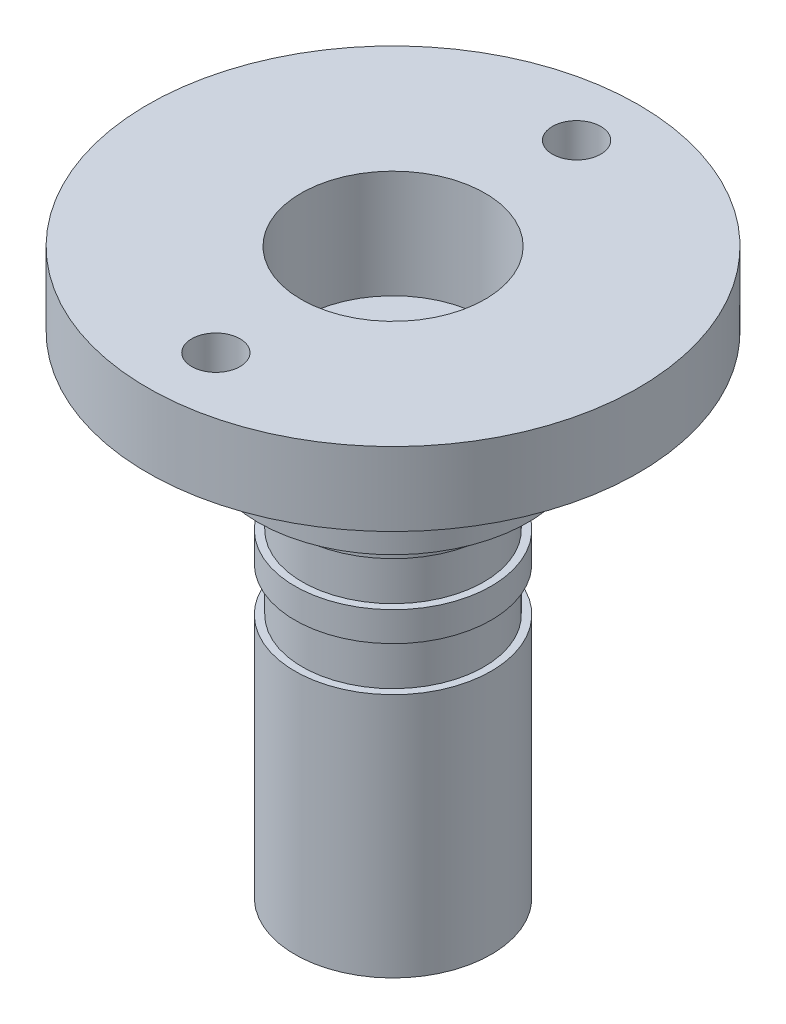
ISO-10303-21;
HEADER;
FILE_DESCRIPTION(('STEP AP214'),'2;1');
FILE_NAME('part.step','',(''),(''),'','','');
FILE_SCHEMA(('AUTOMOTIVE_DESIGN { 1 0 10303 214 1 1 1 1 }'));
ENDSEC;
DATA;
#1=APPLICATION_CONTEXT('core data for automotive mechanical design processes');
#2=APPLICATION_PROTOCOL_DEFINITION('international standard','automotive_design',2000,#1);
#3=PRODUCT_CONTEXT('',#1,'mechanical');
#4=PRODUCT('Part','Part','',(#3));
#5=PRODUCT_RELATED_PRODUCT_CATEGORY('part','',(#4));
#6=PRODUCT_DEFINITION_FORMATION('','',#4);
#7=PRODUCT_DEFINITION_CONTEXT('part definition',#1,'design');
#8=PRODUCT_DEFINITION('design','',#6,#7);
#9=PRODUCT_DEFINITION_SHAPE('','',#8);
#10=(LENGTH_UNIT() NAMED_UNIT(*) SI_UNIT(.MILLI.,.METRE.));
#11=(NAMED_UNIT(*) PLANE_ANGLE_UNIT() SI_UNIT($,.RADIAN.));
#12=(NAMED_UNIT(*) SI_UNIT($,.STERADIAN.) SOLID_ANGLE_UNIT());
#13=UNCERTAINTY_MEASURE_WITH_UNIT(LENGTH_MEASURE(1.E-05),#10,'distance_accuracy_value','');
#14=(GEOMETRIC_REPRESENTATION_CONTEXT(3) GLOBAL_UNCERTAINTY_ASSIGNED_CONTEXT((#13)) GLOBAL_UNIT_ASSIGNED_CONTEXT((#10,
#11,#12)) REPRESENTATION_CONTEXT('',''));
#15=CARTESIAN_POINT('',(0.,0.,0.));
#16=DIRECTION('',(0.,0.,1.));
#17=DIRECTION('',(1.,0.,0.));
#18=AXIS2_PLACEMENT_3D('',#15,#16,#17);
#19=CARTESIAN_POINT('',(0.,16.51,0.));
#20=DIRECTION('',(0.,-1.,0.));
#21=DIRECTION('',(0.,0.,-1.));
#22=AXIS2_PLACEMENT_3D('',#19,#20,#21);
#23=CYLINDRICAL_SURFACE('',#22,12.7);
#24=CARTESIAN_POINT('',(0.,16.51,0.));
#25=DIRECTION('',(0.,-1.,0.));
#26=DIRECTION('',(0.,0.,-1.));
#27=AXIS2_PLACEMENT_3D('',#24,#25,#26);
#28=CIRCLE('',#27,12.7);
#29=CARTESIAN_POINT('',(0.,16.51,-12.7));
#30=VERTEX_POINT('',#29);
#31=EDGE_CURVE('E10',#30,#30,#28,.T.);
#32=ORIENTED_EDGE('',*,*,#31,.T.);
#33=EDGE_LOOP('',(#32));
#34=FACE_BOUND('',#33,.T.);
#35=CARTESIAN_POINT('',(0.,12.7,0.));
#36=DIRECTION('',(0.,-1.,0.));
#37=DIRECTION('',(0.,0.,-1.));
#38=AXIS2_PLACEMENT_3D('',#35,#36,#37);
#39=CIRCLE('',#38,12.7);
#40=CARTESIAN_POINT('',(0.,12.7,-12.7));
#41=VERTEX_POINT('',#40);
#42=EDGE_CURVE('E77',#41,#41,#39,.T.);
#43=ORIENTED_EDGE('',*,*,#42,.F.);
#44=EDGE_LOOP('',(#43));
#45=FACE_BOUND('',#44,.T.);
#46=ADVANCED_FACE('F31',(#34,#45),#23,.T.);
#47=CARTESIAN_POINT('',(12.7,16.51,0.));
#48=DIRECTION('',(0.,1.,0.));
#49=DIRECTION('',(0.,0.,1.));
#50=AXIS2_PLACEMENT_3D('',#47,#48,#49);
#51=PLANE('',#50);
#52=CARTESIAN_POINT('',(0.,16.51,0.));
#53=DIRECTION('',(0.,1.,0.));
#54=DIRECTION('',(0.,0.,1.));
#55=AXIS2_PLACEMENT_3D('',#52,#53,#54);
#56=CIRCLE('',#55,4.76250000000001);
#57=CARTESIAN_POINT('',(0.,16.51,4.76250000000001));
#58=VERTEX_POINT('',#57);
#59=EDGE_CURVE('E101',#58,#58,#56,.T.);
#60=ORIENTED_EDGE('',*,*,#59,.F.);
#61=EDGE_LOOP('',(#60));
#62=FACE_BOUND('',#61,.T.);
#63=CARTESIAN_POINT('',(0.185052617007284,16.51,9.35622749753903));
#64=DIRECTION('',(0.,-1.,0.));
#65=DIRECTION('',(0.,0.,-1.));
#66=AXIS2_PLACEMENT_3D('',#63,#64,#65);
#67=CIRCLE('',#66,1.24993399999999);
#68=CARTESIAN_POINT('',(0.185052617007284,16.51,8.10629349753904));
#69=VERTEX_POINT('',#68);
#70=EDGE_CURVE('E86',#69,#69,#67,.T.);
#71=ORIENTED_EDGE('',*,*,#70,.T.);
#72=EDGE_LOOP('',(#71));
#73=FACE_BOUND('',#72,.T.);
#74=CARTESIAN_POINT('',(0.,16.51,-9.4996));
#75=DIRECTION('',(0.,-1.,0.));
#76=DIRECTION('',(0.,0.,-1.));
#77=AXIS2_PLACEMENT_3D('',#74,#75,#76);
#78=CIRCLE('',#77,1.24993399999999);
#79=CARTESIAN_POINT('',(0.,16.51,-10.749534));
#80=VERTEX_POINT('',#79);
#81=EDGE_CURVE('E80',#80,#80,#78,.T.);
#82=ORIENTED_EDGE('',*,*,#81,.T.);
#83=EDGE_LOOP('',(#82));
#84=FACE_BOUND('',#83,.T.);
#85=ORIENTED_EDGE('',*,*,#31,.F.);
#86=EDGE_LOOP('',(#85));
#87=FACE_BOUND('',#86,.T.);
#88=ADVANCED_FACE('F107',(#62,#73,#84,#87),#51,.T.);
#89=CARTESIAN_POINT('',(0.,-12.7,0.));
#90=DIRECTION('',(0.,-1.,0.));
#91=DIRECTION('',(0.,0.,-1.));
#92=AXIS2_PLACEMENT_3D('',#89,#90,#91);
#93=PLANE('',#92);
#94=CARTESIAN_POINT('',(0.,-12.7,0.));
#95=DIRECTION('',(0.,1.,0.));
#96=DIRECTION('',(0.,0.,1.));
#97=AXIS2_PLACEMENT_3D('',#94,#95,#96);
#98=CIRCLE('',#97,2.54000000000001);
#99=CARTESIAN_POINT('',(0.,-12.7,2.54000000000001));
#100=VERTEX_POINT('',#99);
#101=EDGE_CURVE('E92',#100,#100,#98,.T.);
#102=ORIENTED_EDGE('',*,*,#101,.T.);
#103=EDGE_LOOP('',(#102));
#104=FACE_BOUND('',#103,.T.);
#105=CARTESIAN_POINT('',(0.,-12.7,0.));
#106=DIRECTION('',(0.,-1.,0.));
#107=DIRECTION('',(0.,0.,-1.));
#108=AXIS2_PLACEMENT_3D('',#105,#106,#107);
#109=CIRCLE('',#108,5.08);
#110=CARTESIAN_POINT('',(0.,-12.7,-5.08));
#111=VERTEX_POINT('',#110);
#112=EDGE_CURVE('E37',#111,#111,#109,.T.);
#113=ORIENTED_EDGE('',*,*,#112,.T.);
#114=EDGE_LOOP('',(#113));
#115=FACE_BOUND('',#114,.T.);
#116=ADVANCED_FACE('F110',(#104,#115),#93,.T.);
#117=CARTESIAN_POINT('',(0.,16.51,0.));
#118=DIRECTION('',(0.,-1.,0.));
#119=DIRECTION('',(0.,0.,-1.));
#120=AXIS2_PLACEMENT_3D('',#117,#118,#119);
#121=CYLINDRICAL_SURFACE('',#120,5.08);
#122=CARTESIAN_POINT('',(0.,0.,0.));
#123=DIRECTION('',(0.,-1.,0.));
#124=DIRECTION('',(0.,0.,-1.));
#125=AXIS2_PLACEMENT_3D('',#122,#123,#124);
#126=CIRCLE('',#125,5.08);
#127=CARTESIAN_POINT('',(0.,0.,-5.08));
#128=VERTEX_POINT('',#127);
#129=EDGE_CURVE('E41',#128,#128,#126,.T.);
#130=ORIENTED_EDGE('',*,*,#129,.T.);
#131=EDGE_LOOP('',(#130));
#132=FACE_BOUND('',#131,.T.);
#133=ORIENTED_EDGE('',*,*,#112,.F.);
#134=EDGE_LOOP('',(#133));
#135=FACE_BOUND('',#134,.T.);
#136=ADVANCED_FACE('F189',(#132,#135),#121,.T.);
#137=CARTESIAN_POINT('',(5.08,0.,0.));
#138=DIRECTION('',(0.,1.,0.));
#139=DIRECTION('',(0.,0.,1.));
#140=AXIS2_PLACEMENT_3D('',#137,#138,#139);
#141=PLANE('',#140);
#142=CARTESIAN_POINT('',(0.,0.,0.));
#143=DIRECTION('',(0.,-1.,0.));
#144=DIRECTION('',(0.,0.,-1.));
#145=AXIS2_PLACEMENT_3D('',#142,#143,#144);
#146=CIRCLE('',#145,4.699);
#147=CARTESIAN_POINT('',(0.,0.,-4.699));
#148=VERTEX_POINT('',#147);
#149=EDGE_CURVE('E45',#148,#148,#146,.T.);
#150=ORIENTED_EDGE('',*,*,#149,.T.);
#151=EDGE_LOOP('',(#150));
#152=FACE_BOUND('',#151,.T.);
#153=ORIENTED_EDGE('',*,*,#129,.F.);
#154=EDGE_LOOP('',(#153));
#155=FACE_BOUND('',#154,.T.);
#156=ADVANCED_FACE('F183',(#152,#155),#141,.T.);
#157=CARTESIAN_POINT('',(0.,16.51,0.));
#158=DIRECTION('',(0.,-1.,0.));
#159=DIRECTION('',(0.,0.,-1.));
#160=AXIS2_PLACEMENT_3D('',#157,#158,#159);
#161=CYLINDRICAL_SURFACE('',#160,4.699);
#162=CARTESIAN_POINT('',(0.,2.286,0.));
#163=DIRECTION('',(0.,-1.,0.));
#164=DIRECTION('',(0.,0.,-1.));
#165=AXIS2_PLACEMENT_3D('',#162,#163,#164);
#166=CIRCLE('',#165,4.699);
#167=CARTESIAN_POINT('',(0.,2.286,-4.699));
#168=VERTEX_POINT('',#167);
#169=EDGE_CURVE('E50',#168,#168,#166,.T.);
#170=ORIENTED_EDGE('',*,*,#169,.T.);
#171=EDGE_LOOP('',(#170));
#172=FACE_BOUND('',#171,.T.);
#173=ORIENTED_EDGE('',*,*,#149,.F.);
#174=EDGE_LOOP('',(#173));
#175=FACE_BOUND('',#174,.T.);
#176=ADVANCED_FACE('F177',(#172,#175),#161,.T.);
#177=CARTESIAN_POINT('',(4.699,2.286,0.));
#178=DIRECTION('',(0.,-1.,0.));
#179=DIRECTION('',(0.,0.,-1.));
#180=AXIS2_PLACEMENT_3D('',#177,#178,#179);
#181=PLANE('',#180);
#182=CARTESIAN_POINT('',(0.,2.286,0.));
#183=DIRECTION('',(0.,-1.,0.));
#184=DIRECTION('',(0.,0.,-1.));
#185=AXIS2_PLACEMENT_3D('',#182,#183,#184);
#186=CIRCLE('',#185,5.08);
#187=CARTESIAN_POINT('',(0.,2.286,-5.08));
#188=VERTEX_POINT('',#187);
#189=EDGE_CURVE('E53',#188,#188,#186,.T.);
#190=ORIENTED_EDGE('',*,*,#189,.T.);
#191=EDGE_LOOP('',(#190));
#192=FACE_BOUND('',#191,.T.);
#193=ORIENTED_EDGE('',*,*,#169,.F.);
#194=EDGE_LOOP('',(#193));
#195=FACE_BOUND('',#194,.T.);
#196=ADVANCED_FACE('F171',(#192,#195),#181,.T.);
#197=CARTESIAN_POINT('',(0.,16.51,0.));
#198=DIRECTION('',(0.,-1.,0.));
#199=DIRECTION('',(0.,0.,-1.));
#200=AXIS2_PLACEMENT_3D('',#197,#198,#199);
#201=CYLINDRICAL_SURFACE('',#200,5.08);
#202=CARTESIAN_POINT('',(0.,3.81,0.));
#203=DIRECTION('',(0.,-1.,0.));
#204=DIRECTION('',(0.,0.,-1.));
#205=AXIS2_PLACEMENT_3D('',#202,#203,#204);
#206=CIRCLE('',#205,5.08);
#207=CARTESIAN_POINT('',(0.,3.81,-5.08));
#208=VERTEX_POINT('',#207);
#209=EDGE_CURVE('E56',#208,#208,#206,.T.);
#210=ORIENTED_EDGE('',*,*,#209,.T.);
#211=EDGE_LOOP('',(#210));
#212=FACE_BOUND('',#211,.T.);
#213=ORIENTED_EDGE('',*,*,#189,.F.);
#214=EDGE_LOOP('',(#213));
#215=FACE_BOUND('',#214,.T.);
#216=ADVANCED_FACE('F165',(#212,#215),#201,.T.);
#217=CARTESIAN_POINT('',(5.08,3.81,0.));
#218=DIRECTION('',(0.,1.,0.));
#219=DIRECTION('',(0.,0.,1.));
#220=AXIS2_PLACEMENT_3D('',#217,#218,#219);
#221=PLANE('',#220);
#222=CARTESIAN_POINT('',(0.,3.81,0.));
#223=DIRECTION('',(0.,-1.,0.));
#224=DIRECTION('',(0.,0.,-1.));
#225=AXIS2_PLACEMENT_3D('',#222,#223,#224);
#226=CIRCLE('',#225,4.699);
#227=CARTESIAN_POINT('',(0.,3.81,-4.699));
#228=VERTEX_POINT('',#227);
#229=EDGE_CURVE('E59',#228,#228,#226,.T.);
#230=ORIENTED_EDGE('',*,*,#229,.T.);
#231=EDGE_LOOP('',(#230));
#232=FACE_BOUND('',#231,.T.);
#233=ORIENTED_EDGE('',*,*,#209,.F.);
#234=EDGE_LOOP('',(#233));
#235=FACE_BOUND('',#234,.T.);
#236=ADVANCED_FACE('F159',(#232,#235),#221,.T.);
#237=CARTESIAN_POINT('',(0.,16.51,0.));
#238=DIRECTION('',(0.,-1.,0.));
#239=DIRECTION('',(0.,0.,-1.));
#240=AXIS2_PLACEMENT_3D('',#237,#238,#239);
#241=CYLINDRICAL_SURFACE('',#240,4.699);
#242=CARTESIAN_POINT('',(0.,6.09599999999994,0.));
#243=DIRECTION('',(0.,-1.,0.));
#244=DIRECTION('',(0.,0.,-1.));
#245=AXIS2_PLACEMENT_3D('',#242,#243,#244);
#246=CIRCLE('',#245,4.699);
#247=CARTESIAN_POINT('',(0.,6.09599999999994,-4.699));
#248=VERTEX_POINT('',#247);
#249=EDGE_CURVE('E62',#248,#248,#246,.T.);
#250=ORIENTED_EDGE('',*,*,#249,.T.);
#251=EDGE_LOOP('',(#250));
#252=FACE_BOUND('',#251,.T.);
#253=ORIENTED_EDGE('',*,*,#229,.F.);
#254=EDGE_LOOP('',(#253));
#255=FACE_BOUND('',#254,.T.);
#256=ADVANCED_FACE('F153',(#252,#255),#241,.T.);
#257=CARTESIAN_POINT('',(4.699,6.09599999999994,0.));
#258=DIRECTION('',(0.,-1.,0.));
#259=DIRECTION('',(0.,0.,-1.));
#260=AXIS2_PLACEMENT_3D('',#257,#258,#259);
#261=PLANE('',#260);
#262=CARTESIAN_POINT('',(0.,6.09599999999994,0.));
#263=DIRECTION('',(0.,-1.,0.));
#264=DIRECTION('',(0.,0.,-1.));
#265=AXIS2_PLACEMENT_3D('',#262,#263,#264);
#266=CIRCLE('',#265,5.08);
#267=CARTESIAN_POINT('',(0.,6.09599999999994,-5.08));
#268=VERTEX_POINT('',#267);
#269=EDGE_CURVE('E65',#268,#268,#266,.T.);
#270=ORIENTED_EDGE('',*,*,#269,.T.);
#271=EDGE_LOOP('',(#270));
#272=FACE_BOUND('',#271,.T.);
#273=ORIENTED_EDGE('',*,*,#249,.F.);
#274=EDGE_LOOP('',(#273));
#275=FACE_BOUND('',#274,.T.);
#276=ADVANCED_FACE('F147',(#272,#275),#261,.T.);
#277=CARTESIAN_POINT('',(0.,16.51,0.));
#278=DIRECTION('',(0.,-1.,0.));
#279=DIRECTION('',(0.,0.,-1.));
#280=AXIS2_PLACEMENT_3D('',#277,#278,#279);
#281=CYLINDRICAL_SURFACE('',#280,5.08);
#282=CARTESIAN_POINT('',(0.,7.62000000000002,0.));
#283=DIRECTION('',(0.,-1.,0.));
#284=DIRECTION('',(0.,0.,-1.));
#285=AXIS2_PLACEMENT_3D('',#282,#283,#284);
#286=CIRCLE('',#285,5.08);
#287=CARTESIAN_POINT('',(0.,7.62000000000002,-5.08));
#288=VERTEX_POINT('',#287);
#289=EDGE_CURVE('E68',#288,#288,#286,.T.);
#290=ORIENTED_EDGE('',*,*,#289,.T.);
#291=EDGE_LOOP('',(#290));
#292=FACE_BOUND('',#291,.T.);
#293=ORIENTED_EDGE('',*,*,#269,.F.);
#294=EDGE_LOOP('',(#293));
#295=FACE_BOUND('',#294,.T.);
#296=ADVANCED_FACE('F141',(#292,#295),#281,.T.);
#297=CARTESIAN_POINT('',(5.08,7.62000000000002,0.));
#298=DIRECTION('',(0.,-1.,0.));
#299=DIRECTION('',(0.,0.,-1.));
#300=AXIS2_PLACEMENT_3D('',#297,#298,#299);
#301=PLANE('',#300);
#302=CARTESIAN_POINT('',(0.,7.62000000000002,0.));
#303=DIRECTION('',(0.,-1.,0.));
#304=DIRECTION('',(0.,0.,-1.));
#305=AXIS2_PLACEMENT_3D('',#302,#303,#304);
#306=CIRCLE('',#305,6.985);
#307=CARTESIAN_POINT('',(0.,7.62000000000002,-6.985));
#308=VERTEX_POINT('',#307);
#309=EDGE_CURVE('E71',#308,#308,#306,.T.);
#310=ORIENTED_EDGE('',*,*,#309,.T.);
#311=EDGE_LOOP('',(#310));
#312=FACE_BOUND('',#311,.T.);
#313=ORIENTED_EDGE('',*,*,#289,.F.);
#314=EDGE_LOOP('',(#313));
#315=FACE_BOUND('',#314,.T.);
#316=ADVANCED_FACE('F135',(#312,#315),#301,.T.);
#317=CARTESIAN_POINT('',(0.,16.51,0.));
#318=DIRECTION('',(0.,-1.,0.));
#319=DIRECTION('',(0.,0.,-1.));
#320=AXIS2_PLACEMENT_3D('',#317,#318,#319);
#321=CYLINDRICAL_SURFACE('',#320,6.985);
#322=CARTESIAN_POINT('',(0.,12.7,0.));
#323=DIRECTION('',(0.,-1.,0.));
#324=DIRECTION('',(0.,0.,-1.));
#325=AXIS2_PLACEMENT_3D('',#322,#323,#324);
#326=CIRCLE('',#325,6.985);
#327=CARTESIAN_POINT('',(0.,12.7,-6.985));
#328=VERTEX_POINT('',#327);
#329=EDGE_CURVE('E74',#328,#328,#326,.T.);
#330=ORIENTED_EDGE('',*,*,#329,.T.);
#331=EDGE_LOOP('',(#330));
#332=FACE_BOUND('',#331,.T.);
#333=ORIENTED_EDGE('',*,*,#309,.F.);
#334=EDGE_LOOP('',(#333));
#335=FACE_BOUND('',#334,.T.);
#336=ADVANCED_FACE('F126',(#332,#335),#321,.T.);
#337=CARTESIAN_POINT('',(6.985,12.7,0.));
#338=DIRECTION('',(0.,-1.,0.));
#339=DIRECTION('',(0.,0.,-1.));
#340=AXIS2_PLACEMENT_3D('',#337,#338,#339);
#341=PLANE('',#340);
#342=CARTESIAN_POINT('',(0.185052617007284,12.7,9.35622749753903));
#343=DIRECTION('',(0.,-1.,0.));
#344=DIRECTION('',(0.,0.,-1.));
#345=AXIS2_PLACEMENT_3D('',#342,#343,#344);
#346=CIRCLE('',#345,1.24993399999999);
#347=CARTESIAN_POINT('',(0.185052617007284,12.7,8.10629349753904));
#348=VERTEX_POINT('',#347);
#349=EDGE_CURVE('E89',#348,#348,#346,.T.);
#350=ORIENTED_EDGE('',*,*,#349,.F.);
#351=EDGE_LOOP('',(#350));
#352=FACE_BOUND('',#351,.T.);
#353=CARTESIAN_POINT('',(0.,12.7,-9.4996));
#354=DIRECTION('',(0.,-1.,0.));
#355=DIRECTION('',(0.,0.,-1.));
#356=AXIS2_PLACEMENT_3D('',#353,#354,#355);
#357=CIRCLE('',#356,1.24993399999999);
#358=CARTESIAN_POINT('',(0.,12.7,-10.749534));
#359=VERTEX_POINT('',#358);
#360=EDGE_CURVE('E83',#359,#359,#357,.T.);
#361=ORIENTED_EDGE('',*,*,#360,.F.);
#362=EDGE_LOOP('',(#361));
#363=FACE_BOUND('',#362,.T.);
#364=ORIENTED_EDGE('',*,*,#42,.T.);
#365=EDGE_LOOP('',(#364));
#366=FACE_BOUND('',#365,.T.);
#367=ORIENTED_EDGE('',*,*,#329,.F.);
#368=EDGE_LOOP('',(#367));
#369=FACE_BOUND('',#368,.T.);
#370=ADVANCED_FACE('F120',(#352,#363,#366,#369),#341,.T.);
#371=CARTESIAN_POINT('',(0.,12.7,-9.4996));
#372=DIRECTION('',(0.,-1.,0.));
#373=DIRECTION('',(0.,0.,-1.));
#374=AXIS2_PLACEMENT_3D('',#371,#372,#373);
#375=CYLINDRICAL_SURFACE('',#374,1.24993399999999);
#376=ORIENTED_EDGE('',*,*,#81,.F.);
#377=EDGE_LOOP('',(#376));
#378=FACE_BOUND('',#377,.T.);
#379=ORIENTED_EDGE('',*,*,#360,.T.);
#380=EDGE_LOOP('',(#379));
#381=FACE_BOUND('',#380,.T.);
#382=ADVANCED_FACE('F116',(#378,#381),#375,.F.);
#383=CARTESIAN_POINT('',(0.185052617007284,12.7,9.35622749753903));
#384=DIRECTION('',(0.,-1.,0.));
#385=DIRECTION('',(0.,0.,-1.));
#386=AXIS2_PLACEMENT_3D('',#383,#384,#385);
#387=CYLINDRICAL_SURFACE('',#386,1.24993399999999);
#388=ORIENTED_EDGE('',*,*,#70,.F.);
#389=EDGE_LOOP('',(#388));
#390=FACE_BOUND('',#389,.T.);
#391=ORIENTED_EDGE('',*,*,#349,.T.);
#392=EDGE_LOOP('',(#391));
#393=FACE_BOUND('',#392,.T.);
#394=ADVANCED_FACE('F119',(#390,#393),#387,.F.);
#395=CARTESIAN_POINT('',(0.,16.51,0.));
#396=DIRECTION('',(0.,1.,0.));
#397=DIRECTION('',(0.,0.,1.));
#398=AXIS2_PLACEMENT_3D('',#395,#396,#397);
#399=CYLINDRICAL_SURFACE('',#398,2.54000000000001);
#400=ORIENTED_EDGE('',*,*,#101,.F.);
#401=EDGE_LOOP('',(#400));
#402=FACE_BOUND('',#401,.T.);
#403=CARTESIAN_POINT('',(0.,10.922,0.));
#404=DIRECTION('',(0.,1.,0.));
#405=DIRECTION('',(0.,0.,1.));
#406=AXIS2_PLACEMENT_3D('',#403,#404,#405);
#407=CIRCLE('',#406,2.54000000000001);
#408=CARTESIAN_POINT('',(0.,10.922,2.54000000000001));
#409=VERTEX_POINT('',#408);
#410=EDGE_CURVE('E95',#409,#409,#407,.T.);
#411=ORIENTED_EDGE('',*,*,#410,.T.);
#412=EDGE_LOOP('',(#411));
#413=FACE_BOUND('',#412,.T.);
#414=ADVANCED_FACE('F220',(#402,#413),#399,.F.);
#415=CARTESIAN_POINT('',(2.54000000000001,10.922,0.));
#416=DIRECTION('',(0.,-1.,0.));
#417=DIRECTION('',(0.,0.,-1.));
#418=AXIS2_PLACEMENT_3D('',#415,#416,#417);
#419=PLANE('',#418);
#420=ORIENTED_EDGE('',*,*,#410,.F.);
#421=EDGE_LOOP('',(#420));
#422=FACE_BOUND('',#421,.T.);
#423=CARTESIAN_POINT('',(0.,10.922,0.));
#424=DIRECTION('',(0.,1.,0.));
#425=DIRECTION('',(0.,0.,1.));
#426=AXIS2_PLACEMENT_3D('',#423,#424,#425);
#427=CIRCLE('',#426,4.76250000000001);
#428=CARTESIAN_POINT('',(0.,10.922,4.76250000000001));
#429=VERTEX_POINT('',#428);
#430=EDGE_CURVE('E98',#429,#429,#427,.T.);
#431=ORIENTED_EDGE('',*,*,#430,.T.);
#432=EDGE_LOOP('',(#431));
#433=FACE_BOUND('',#432,.T.);
#434=ADVANCED_FACE('F225',(#422,#433),#419,.F.);
#435=CARTESIAN_POINT('',(0.,16.51,0.));
#436=DIRECTION('',(0.,1.,0.));
#437=DIRECTION('',(0.,0.,1.));
#438=AXIS2_PLACEMENT_3D('',#435,#436,#437);
#439=CYLINDRICAL_SURFACE('',#438,4.76250000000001);
#440=ORIENTED_EDGE('',*,*,#430,.F.);
#441=EDGE_LOOP('',(#440));
#442=FACE_BOUND('',#441,.T.);
#443=ORIENTED_EDGE('',*,*,#59,.T.);
#444=EDGE_LOOP('',(#443));
#445=FACE_BOUND('',#444,.T.);
#446=ADVANCED_FACE('F105',(#442,#445),#439,.F.);
#447=CLOSED_SHELL('',(#46,#88,#116,#136,#156,#176,#196,#216,#236,#256,#276,#296,#316,#336,#370,
#382,#394,#414,#434,#446));
#448=MANIFOLD_SOLID_BREP('B2',#447);
#449=ADVANCED_BREP_SHAPE_REPRESENTATION('',(#18,#448),#14);
#450=SHAPE_DEFINITION_REPRESENTATION(#9,#449);
ENDSEC;
END-ISO-10303-21;
